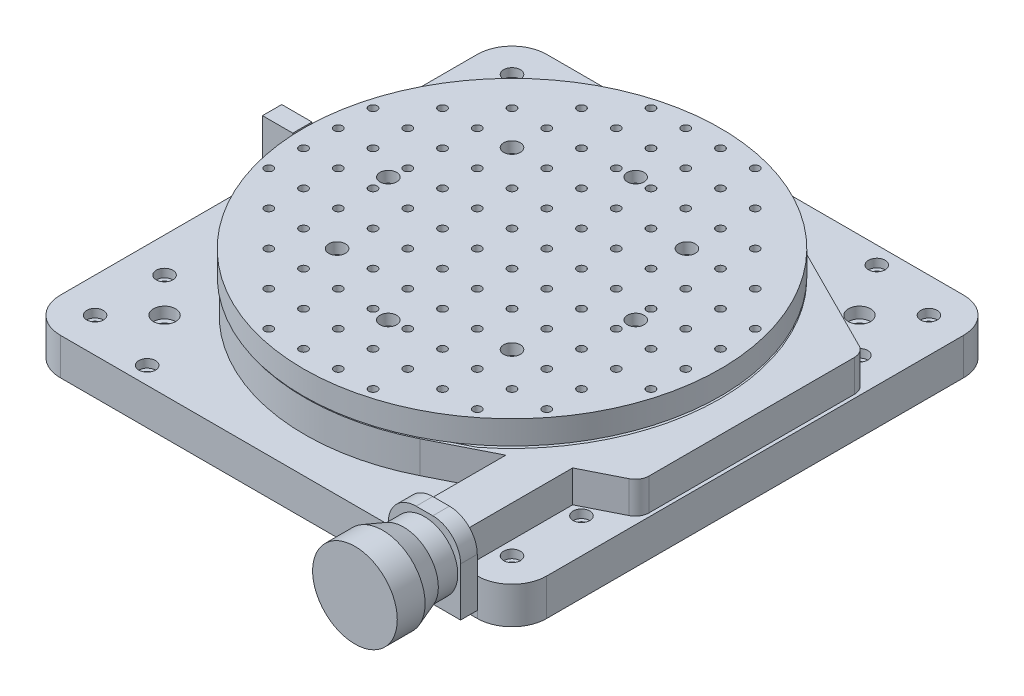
from build123d import *

# Parameters (mm, degrees)
SKETCH1_R            = 45
BOSS_EXTRUDE1_DEPTH  = 26.5
BOSS_EXTRUDE2_DEPTH  = 23
SKETCH3_R            = 55.758206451
SKETCH3_R_2          = 45
BOSS_EXTRUDE3_DEPTH  = 24.5
SKETCH4_R            = 150
SKETCH4_R_2          = 45
BOSS_EXTRUDE4_DEPTH  = 17
BOSS_EXTRUDE6_START  = -2
BOSS_EXTRUDE6_DEPTH  = 2
BOSS_EXTRUDE7_DEPTH  = 21
BOSS_EXTRUDE8_DEPTH  = 75
SKETCH9_W            = 94.583503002
SKETCH9_H            = 30
BOSS_EXTRUDE9_DEPTH  = 25
CHAMFER1_SIZE        = 3
SKETCH10_R           = 4.5
SKETCH10_R_2         = 3.25
CUT_EXTRUDE1_DEPTH   = 98
SKETCH11_R           = 8
CUT_EXTRUDE2_DEPTH   = 8
SKETCH12_R           = 6
CUT_EXTRUDE3_DEPTH   = 6
SKETCH14_R           = 3.5
CUT_EXTRUDE4_DEPTH   = 18
SKETCH15_R           = 6
CUT_EXTRUDE5_DEPTH   = 8
SKETCH16_R           = 3
CUT_EXTRUDE6_DEPTH   = 8
SKETCH17_W           = 21.793248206
SKETCH17_H           = 13.859681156
BOSS_EXTRUDE11_DEPTH = 41.5
SKETCH19_W           = 101.812352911
SKETCH19_H           = 99.807594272
CUT_EXTRUDE7_DEPTH   = 107
SKETCH20_W           = 84
SKETCH20_H           = 45
BOSS_EXTRUDE12_DEPTH = 26.5
FILLET1_R            = 25
SKETCH21_W           = 52
SKETCH21_H           = 55
BOSS_EXTRUDE13_DEPTH = 12
BOSS_EXTRUDE14_REACH = 409.79
SKETCH22_W           = 32
SKETCH22_H           = 34
SKETCH24_R           = 24
BOSS_EXTRUDE15_DEPTH = 15
SKETCH25_R           = 25
BOSS_EXTRUDE16_DEPTH = 15
BOSS_EXTRUDE16_DRAFT = -20
SKETCH26_R           = 30.459553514
BOSS_EXTRUDE17_DEPTH = 20
FILLET4_R            = 20
BOSS_EXTRUDE18_START = -12
SKETCH27_R           = 45
BOSS_EXTRUDE18_DEPTH = 12
SKETCH28_R           = 3
CUT_EXTRUDE8_DEPTH   = 10
SKETCH30_R           = 6
CUT_EXTRUDE9_DEPTH   = 6
SKETCH31_R           = 3.25
CUT_EXTRUDE10_DEPTH  = 66
SKETCH32_R           = 45
BOSS_EXTRUDE19_DEPTH = 10


with BuildPart() as part:
    # Sketch1 → Boss-Extrude1 (new body)
    with BuildSketch(Plane(origin=(0, 0, 0), x_dir=(1, 0, 0), z_dir=(0, 1, 0))):
        with BuildLine():
            Line((-150, 175), (150, 175))
            ThreePointArc((150, 175), (167.67766953, 167.67766953), (175, 150))
            Line((175, 150), (175, -130))
            Line((175, -130), (91, -130))
            Line((91, -130), (91, -175))
            Line((91, -175), (-150, -175))
            ThreePointArc((-150, -175), (-167.67766953, -167.67766953), (-175, -150))
            Line((-175, -150), (-175, 150))
            ThreePointArc((-175, 150), (-167.67766953, 167.67766953), (-150, 175))
        make_face()
        with Locations(Location((0, 0, 0), (0, 0, 270))):
            Circle(SKETCH1_R, mode=Mode.SUBTRACT)
    extrude(amount=BOSS_EXTRUDE1_DEPTH)

    # Sketch2 → Boss-Extrude2 (add)
    with BuildSketch(Plane(origin=(0, 26.5, 0), x_dir=(1, 0, 0), z_dir=(0, 1, 0))):
        with BuildLine():
            Line((172.5, 73.837252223), (172.5, -73.837252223))
            ThreePointArc((172.5, -73.837252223), (171.013198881, -79.083721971), (166.994911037, -82.7701003))
            Line((166.994911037, -82.7701003), (66.974174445, -133.099436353))
            ThreePointArc((66.974174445, -133.099436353), (-149, 0), (66.974174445, 133.099436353))
            Line((66.974174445, 133.099436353), (166.994911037, 82.7701003))
            ThreePointArc((166.994911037, 82.7701003), (171.013198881, 79.083721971), (172.5, 73.837252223))
        make_face()
        with BuildLine():
            Line((66.075192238, -131.312866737), (166.095928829, -80.983530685))
            ThreePointArc((166.095928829, -80.983530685), (169.310559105, -78.034428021), (170.5, -73.837252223))
            Line((170.5, -73.837252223), (170.5, 73.837252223))
            ThreePointArc((170.5, 73.837252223), (169.310559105, 78.034428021), (166.095928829, 80.983530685))
            Line((166.095928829, 80.983530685), (66.075192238, 131.312866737))
            ThreePointArc((66.075192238, 131.312866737), (-147, 0), (66.075192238, -131.312866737))
        make_face(mode=Mode.SUBTRACT)
    extrude(amount=BOSS_EXTRUDE2_DEPTH)

    # Sketch3 → Boss-Extrude3 (add)
    with BuildSketch(Plane(origin=(0, 26.5, 0), x_dir=(1, 0, 0), z_dir=(0, 1, 0))):
        with Locations(Location((0, 0, 0), (0, 0, 90))):
            Circle(SKETCH3_R)
        with Locations(Location((0, 0, 0), (0, 0, 270))):
            Circle(SKETCH3_R_2, mode=Mode.SUBTRACT)
    extrude(amount=BOSS_EXTRUDE3_DEPTH)

    # Sketch4 → Boss-Extrude4 (add)
    with BuildSketch(Plane(origin=(0, 51, 0), x_dir=(1, 0, 0), z_dir=(0, 1, 0))):
        with Locations(Location((0, 0, 0), (0, 0, 270))):
            Circle(SKETCH4_R)
        with Locations(Location((0, 0, 0), (0, 0, 270))):
            Circle(SKETCH4_R_2, mode=Mode.SUBTRACT)
    extrude(amount=BOSS_EXTRUDE4_DEPTH)

    # Sketch5 → Boss-Extrude6 (add)
    with BuildSketch(Plane(origin=(0, 49.5, 0), x_dir=(1, 0, 0), z_dir=(0, 1, 0)).offset(BOSS_EXTRUDE6_START)):
        with BuildLine():
            Line((82.420512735, -125.327008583), (166.994911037, -82.7701003))
            ThreePointArc((166.994911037, -82.7701003), (171.013198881, -79.083721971), (172.5, -73.837252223))
            Line((172.5, -73.837252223), (172.5, 73.837252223))
            ThreePointArc((172.5, 73.837252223), (171.013198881, 79.083721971), (166.994911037, 82.7701003))
            Line((166.994911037, 82.7701003), (82.420512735, 125.327008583))
            ThreePointArc((82.420512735, 125.327008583), (150, 0), (82.420512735, -125.327008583))
        make_face()
    extrude(amount=BOSS_EXTRUDE6_DEPTH)

    # Sketch7 → Boss-Extrude7 (add)
    with BuildSketch(Plane.XY.offset(130)):
        with BuildLine():
            Line((99, 64), (149, 64))
            ThreePointArc((149, 64), (152.535533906, 62.535533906), (154, 59))
            Line((154, 59), (154, 6))
            ThreePointArc((154, 6), (152.535533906, 2.464466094), (149, 1))
            Line((149, 1), (99, 1))
            ThreePointArc((99, 1), (95.464466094, 2.464466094), (94, 6))
            Line((94, 6), (94, 59))
            ThreePointArc((94, 59), (95.464466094, 62.535533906), (99, 64))
        make_face()
    extrude(amount=BOSS_EXTRUDE7_DEPTH)

    # Sketch8 → Boss-Extrude8 (add)
    with BuildSketch(Plane.XY.offset(151)):
        with BuildLine():
            Line((97.136050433, 2.826690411), (150.863949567, 2.826690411))
            ThreePointArc((150.863949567, 2.826690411), (152.278163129, 3.412476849), (152.863949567, 4.826690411))
            Line((152.863949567, 4.826690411), (152.863949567, 60.173309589))
            ThreePointArc((152.863949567, 60.173309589), (152.278163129, 61.587523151), (150.863949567, 62.173309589))
            Line((150.863949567, 62.173309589), (97.136050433, 62.173309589))
            ThreePointArc((97.136050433, 62.173309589), (95.721836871, 61.587523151), (95.136050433, 60.173309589))
            Line((95.136050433, 60.173309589), (95.136050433, 4.826690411))
            ThreePointArc((95.136050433, 4.826690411), (95.721836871, 3.412476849), (97.136050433, 2.826690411))
        make_face()
    extrude(amount=BOSS_EXTRUDE8_DEPTH)

    # Sketch9 → Boss-Extrude9 (add)
    with BuildSketch(Plane(origin=(154, 0, 0), x_dir=(0, 0, -1), z_dir=(1, 0, 0))):
        with Locations((-178.708248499, 33.283024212)):
            Rectangle(SKETCH9_W, SKETCH9_H)
    extrude(amount=BOSS_EXTRUDE9_DEPTH)

    # Chamfer1
    chamfer1_edges = [part.edges().sort_by_distance(p)[0] for p in [
        (179, 48.283024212, 178.708248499),
        (179, 18.283024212, 178.708248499),
    ]]
    chamfer(chamfer1_edges, length=CHAMFER1_SIZE)

    # Sketch10 → Cut-Extrude1 (cut)
    with BuildSketch(Plane(origin=(0, 26.5, 0), x_dir=(1, 0, 0), z_dir=(0, 1, 0))):
        with Locations(Location((-125, 125, 0), (0, 0, 270))):
            Circle(SKETCH10_R)
        with Locations(Location((125, 125, 0), (0, 0, 270))):
            Circle(SKETCH10_R)
        with Locations(Location((-125, -125, 0), (0, 0, 270))):
            Circle(SKETCH10_R)
        with Locations(Location((-150, 150, 0), (0, 0, 270))):
            Circle(SKETCH10_R_2)
        with Locations(Location((150, 150, 0), (0, 0, 270))):
            Circle(SKETCH10_R_2)
        with Locations(Location((-150, -150, 0), (0, 0, 270))):
            Circle(SKETCH10_R_2)
        with Locations(Location((-150, -100, 0), (0, 0, 270))):
            Circle(SKETCH10_R_2)
        with Locations(Location((-150, 100, 0), (0, 0, 270))):
            Circle(SKETCH10_R_2)
        with Locations(Location((150, 100, 0), (0, 0, 270))):
            Circle(SKETCH10_R_2)
        with Locations(Location((150, -100, 0), (0, 0, 270))):
            Circle(SKETCH10_R_2)
        with Locations(Location((-100, -162.5, 0), (0, 0, 270))):
            Circle(SKETCH10_R_2)
        with Locations(Location((-100, 162.5, 0), (0, 0, 270))):
            Circle(SKETCH10_R_2)
        with Locations(Location((100, 162.5, 0), (0, 0, 270))):
            Circle(SKETCH10_R_2)
    extrude(amount=-CUT_EXTRUDE1_DEPTH, mode=Mode.SUBTRACT)

    # Sketch11 → Cut-Extrude2 (cut)
    with BuildSketch(Plane(origin=(0, 26.5, 0), x_dir=(1, 0, 0), z_dir=(0, 1, 0))):
        with Locations(Location((-125, 125, 0), (0, 0, 270))):
            Circle(SKETCH11_R)
        with Locations(Location((125, 125, 0), (0, 0, 270))):
            Circle(SKETCH11_R)
        with Locations(Location((-125, -125, 0), (0, 0, 270))):
            Circle(SKETCH11_R)
    extrude(amount=-CUT_EXTRUDE2_DEPTH, mode=Mode.SUBTRACT)

    # Sketch12 → Cut-Extrude3 (cut)
    with BuildSketch(Plane(origin=(0, 26.5, 0), x_dir=(1, 0, 0), z_dir=(0, 1, 0))):
        with Locations(Location((-100, 162.5, 0), (0, 0, 270))):
            Circle(SKETCH12_R)
        with Locations(Location((-150, 100, 0), (0, 0, 270))):
            Circle(SKETCH12_R)
        with Locations(Location((-150, 150, 0), (0, 0, 270))):
            Circle(SKETCH12_R)
        with Locations(Location((100, 162.5, 0), (0, 0, 270))):
            Circle(SKETCH12_R)
        with Locations(Location((150, 150, 0), (0, 0, 270))):
            Circle(SKETCH12_R)
        with Locations(Location((150, 100, 0), (0, 0, 270))):
            Circle(SKETCH12_R)
        with Locations(Location((150, -100, 0), (0, 0, 270))):
            Circle(SKETCH12_R)
        with Locations(Location((-100, -162.5, 0), (0, 0, 270))):
            Circle(SKETCH12_R)
        with Locations(Location((-150, -150, 0), (0, 0, 270))):
            Circle(SKETCH12_R)
        with Locations(Location((-150, -100, 0), (0, 0, 270))):
            Circle(SKETCH12_R)
    extrude(amount=-CUT_EXTRUDE3_DEPTH, mode=Mode.SUBTRACT)

    # Sketch14 → Cut-Extrude4 (cut)
    with BuildSketch(Plane(origin=(0, 68, 0), x_dir=(1, 0, 0), z_dir=(0, 1, 0))):
        with Locations(Location((0, 89, 0), (0, 0, 270))):
            Circle(SKETCH14_R)
        with Locations(Location((62.932503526, 62.932503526, 0), (0, 0, 270))):
            Circle(SKETCH14_R)
        with Locations(Location((89, 0, 0), (0, 0, 270))):
            Circle(SKETCH14_R)
        with Locations(Location((62.932503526, -62.932503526, 0), (0, 0, 270))):
            Circle(SKETCH14_R)
        with Locations(Location((0, -89, 0), (0, 0, 270))):
            Circle(SKETCH14_R)
        with Locations(Location((-62.932503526, -62.932503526, 0), (0, 0, 270))):
            Circle(SKETCH14_R)
        with Locations(Location((-89, 0, 0), (0, 0, 270))):
            Circle(SKETCH14_R)
        with Locations(Location((-62.932503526, 62.932503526, 0), (0, 0, 270))):
            Circle(SKETCH14_R)
    extrude(amount=-CUT_EXTRUDE4_DEPTH, mode=Mode.SUBTRACT)

    # Sketch15 → Cut-Extrude5 (cut)
    with BuildSketch(Plane(origin=(0, 68, 0), x_dir=(1, 0, 0), z_dir=(0, 1, 0))):
        with Locations(Location((0, 89, 0), (0, 0, 270))):
            Circle(SKETCH15_R)
        with Locations(Location((62.932503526, 62.932503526, 0), (0, 0, 270))):
            Circle(SKETCH15_R)
        with Locations(Location((89, 0, 0), (0, 0, 270))):
            Circle(SKETCH15_R)
        with Locations(Location((62.932503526, -62.932503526, 0), (0, 0, 270))):
            Circle(SKETCH15_R)
        with Locations(Location((0, -89, 0), (0, 0, 270))):
            Circle(SKETCH15_R)
        with Locations(Location((-62.932503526, -62.932503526, 0), (0, 0, 270))):
            Circle(SKETCH15_R)
        with Locations(Location((-89, 0, 0), (0, 0, 270))):
            Circle(SKETCH15_R)
        with Locations(Location((-62.932503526, 62.932503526, 0), (0, 0, 270))):
            Circle(SKETCH15_R)
    extrude(amount=-CUT_EXTRUDE5_DEPTH, mode=Mode.SUBTRACT)

    # Sketch16 → Cut-Extrude6 (cut)
    with BuildSketch(Plane(origin=(0, 68, 0), x_dir=(1, 0, 0), z_dir=(0, 1, 0))):
        with Locations(Location((-37.5, 37.5, 0), (0, 0, 270))):
            Circle(SKETCH16_R)
        with Locations(Location((37.5, 37.5, 0), (0, 0, 270))):
            Circle(SKETCH16_R)
        with Locations(Location((37.5, -37.5, 0), (0, 0, 270))):
            Circle(SKETCH16_R)
        with Locations(Location((-37.5, -37.5, 0), (0, 0, 270))):
            Circle(SKETCH16_R)
        with Locations(Location((-62.5, 37.5, 0), (0, 0, 270))):
            Circle(SKETCH16_R)
        with Locations(Location((-87.5, 37.5, 0), (0, 0, 270))):
            Circle(SKETCH16_R)
        with Locations(Location((-112.5, 37.5, 0), (0, 0, 270))):
            Circle(SKETCH16_R)
        with Locations(Location((-137.5, 37.5, 0), (0, 0, 270))):
            Circle(SKETCH16_R)
        with Locations(Location((-87.5, 62.5, 0), (0, 0, 270))):
            Circle(SKETCH16_R)
        with Locations(Location((-112.5, 62.5, 0), (0, 0, 270))):
            Circle(SKETCH16_R)
        with Locations((-12.5, 37.5)):
            Circle(SKETCH16_R)
        with Locations(Location((-62.5, 87.5, 0), (0, 0, 270))):
            Circle(SKETCH16_R)
        with Locations(Location((-87.5, 87.5, 0), (0, 0, 270))):
            Circle(SKETCH16_R)
        with Locations(Location((-12.5, 62.5, 0), (0, 0, 270))):
            Circle(SKETCH16_R)
        with Locations(Location((-12.5, 87.5, 0), (0, 0, 270))):
            Circle(SKETCH16_R)
        with Locations(Location((-62.5, 112.5, 0), (0, 0, 270))):
            Circle(SKETCH16_R)
        with Locations(Location((-12.5, 112.5, 0), (0, 0, 270))):
            Circle(SKETCH16_R)
        with Locations(Location((-12.5, 137.5, 0), (0, 0, 270))):
            Circle(SKETCH16_R)
        with Locations((12.5, 37.5)):
            Circle(SKETCH16_R)
        with Locations(Location((12.5, 62.5, 0), (0, 0, 270))):
            Circle(SKETCH16_R)
        with Locations(Location((12.5, 87.5, 0), (0, 0, 270))):
            Circle(SKETCH16_R)
        with Locations(Location((12.5, 112.5, 0), (0, 0, 270))):
            Circle(SKETCH16_R)
        with Locations(Location((12.5, 137.5, 0), (0, 0, 270))):
            Circle(SKETCH16_R)
        with Locations(Location((-37.5, 62.5, 0), (0, 0, 270))):
            Circle(SKETCH16_R)
        with Locations(Location((-37.5, 87.5, 0), (0, 0, 270))):
            Circle(SKETCH16_R)
        with Locations(Location((-37.5, 112.5, 0), (0, 0, 270))):
            Circle(SKETCH16_R)
        with Locations(Location((-37.5, -137.5, 0), (0, 0, 270))):
            Circle(SKETCH16_R)
        with Locations(Location((37.5, 62.5, 0), (0, 0, 270))):
            Circle(SKETCH16_R)
        with Locations(Location((37.5, 87.5, 0), (0, 0, 270))):
            Circle(SKETCH16_R)
        with Locations(Location((37.5, 112.5, 0), (0, 0, 270))):
            Circle(SKETCH16_R)
        with Locations(Location((37.5, -137.5, 0), (0, 0, 270))):
            Circle(SKETCH16_R)
        with Locations(Location((62.5, 37.5, 0), (0, 0, 270))):
            Circle(SKETCH16_R)
        with Locations(Location((62.5, 87.5, 0), (0, 0, 270))):
            Circle(SKETCH16_R)
        with Locations(Location((62.5, 112.5, 0), (0, 0, 270))):
            Circle(SKETCH16_R)
        with Locations((-37.5, 12.5)):
            Circle(SKETCH16_R)
        with Locations(Location((87.5, 37.5, 0), (0, 0, 270))):
            Circle(SKETCH16_R)
        with Locations(Location((87.5, 62.5, 0), (0, 0, 270))):
            Circle(SKETCH16_R)
        with Locations(Location((87.5, 87.5, 0), (0, 0, 270))):
            Circle(SKETCH16_R)
        with Locations((37.5, 12.5)):
            Circle(SKETCH16_R)
        with Locations(Location((-62.5, 12.5, 0), (0, 0, 270))):
            Circle(SKETCH16_R)
        with Locations(Location((112.5, 37.5, 0), (0, 0, 270))):
            Circle(SKETCH16_R)
        with Locations(Location((112.5, 62.5, 0), (0, 0, 270))):
            Circle(SKETCH16_R)
        with Locations(Location((-87.5, 12.5, 0), (0, 0, 270))):
            Circle(SKETCH16_R)
        with Locations(Location((-112.5, 12.5, 0), (0, 0, 270))):
            Circle(SKETCH16_R)
        with Locations(Location((-137.5, 12.5, 0), (0, 0, 270))):
            Circle(SKETCH16_R)
        with Locations(Location((137.5, 37.5, 0), (0, 0, 270))):
            Circle(SKETCH16_R)
        with Locations((-12.5, 12.5)):
            Circle(SKETCH16_R)
        with Locations((12.5, 12.5)):
            Circle(SKETCH16_R)
        with Locations(Location((62.5, 12.5, 0), (0, 0, 270))):
            Circle(SKETCH16_R)
        with Locations(Location((87.5, 12.5, 0), (0, 0, 270))):
            Circle(SKETCH16_R)
        with Locations(Location((112.5, 12.5, 0), (0, 0, 270))):
            Circle(SKETCH16_R)
        with Locations(Location((137.5, 12.5, 0), (0, 0, 270))):
            Circle(SKETCH16_R)
        with Locations((-37.5, -12.5)):
            Circle(SKETCH16_R)
        with Locations((37.5, -12.5)):
            Circle(SKETCH16_R)
        with Locations(Location((-62.5, -12.5, 0), (0, 0, 270))):
            Circle(SKETCH16_R)
        with Locations(Location((-87.5, -12.5, 0), (0, 0, 270))):
            Circle(SKETCH16_R)
        with Locations(Location((-112.5, -12.5, 0), (0, 0, 270))):
            Circle(SKETCH16_R)
        with Locations(Location((-137.5, -12.5, 0), (0, 0, 270))):
            Circle(SKETCH16_R)
        with Locations((-12.5, -12.5)):
            Circle(SKETCH16_R)
        with Locations((12.5, -12.5)):
            Circle(SKETCH16_R)
        with Locations(Location((62.5, -12.5, 0), (0, 0, 270))):
            Circle(SKETCH16_R)
        with Locations(Location((87.5, -12.5, 0), (0, 0, 270))):
            Circle(SKETCH16_R)
        with Locations(Location((112.5, -12.5, 0), (0, 0, 270))):
            Circle(SKETCH16_R)
        with Locations(Location((137.5, -12.5, 0), (0, 0, 270))):
            Circle(SKETCH16_R)
        with Locations(Location((-62.5, -37.5, 0), (0, 0, 270))):
            Circle(SKETCH16_R)
        with Locations(Location((-87.5, -37.5, 0), (0, 0, 270))):
            Circle(SKETCH16_R)
        with Locations(Location((-112.5, -37.5, 0), (0, 0, 270))):
            Circle(SKETCH16_R)
        with Locations(Location((-137.5, -37.5, 0), (0, 0, 270))):
            Circle(SKETCH16_R)
        with Locations((-12.5, -37.5)):
            Circle(SKETCH16_R)
        with Locations((12.5, -37.5)):
            Circle(SKETCH16_R)
        with Locations(Location((62.5, -37.5, 0), (0, 0, 270))):
            Circle(SKETCH16_R)
        with Locations(Location((87.5, -37.5, 0), (0, 0, 270))):
            Circle(SKETCH16_R)
        with Locations(Location((112.5, -37.5, 0), (0, 0, 270))):
            Circle(SKETCH16_R)
        with Locations(Location((137.5, -37.5, 0), (0, 0, 270))):
            Circle(SKETCH16_R)
        with Locations(Location((-37.5, -62.5, 0), (0, 0, 270))):
            Circle(SKETCH16_R)
        with Locations(Location((37.5, -62.5, 0), (0, 0, 270))):
            Circle(SKETCH16_R)
        with Locations(Location((-87.5, -62.5, 0), (0, 0, 270))):
            Circle(SKETCH16_R)
        with Locations(Location((-112.5, -62.5, 0), (0, 0, 270))):
            Circle(SKETCH16_R)
        with Locations(Location((-37.5, 137.5, 0), (0, 0, 270))):
            Circle(SKETCH16_R)
        with Locations(Location((-12.5, -62.5, 0), (0, 0, 270))):
            Circle(SKETCH16_R)
        with Locations(Location((12.5, -62.5, 0), (0, 0, 270))):
            Circle(SKETCH16_R)
        with Locations(Location((87.5, -62.5, 0), (0, 0, 270))):
            Circle(SKETCH16_R)
        with Locations(Location((112.5, -62.5, 0), (0, 0, 270))):
            Circle(SKETCH16_R)
        with Locations(Location((37.5, 137.5, 0), (0, 0, 270))):
            Circle(SKETCH16_R)
        with Locations(Location((-37.5, -87.5, 0), (0, 0, 270))):
            Circle(SKETCH16_R)
        with Locations(Location((37.5, -87.5, 0), (0, 0, 270))):
            Circle(SKETCH16_R)
        with Locations(Location((-62.5, -87.5, 0), (0, 0, 270))):
            Circle(SKETCH16_R)
        with Locations(Location((-87.5, -87.5, 0), (0, 0, 270))):
            Circle(SKETCH16_R)
        with Locations(Location((-12.5, -87.5, 0), (0, 0, 270))):
            Circle(SKETCH16_R)
        with Locations(Location((12.5, -87.5, 0), (0, 0, 270))):
            Circle(SKETCH16_R)
        with Locations(Location((62.5, -87.5, 0), (0, 0, 270))):
            Circle(SKETCH16_R)
        with Locations(Location((87.5, -87.5, 0), (0, 0, 270))):
            Circle(SKETCH16_R)
        with Locations(Location((112.5, -87.5, 0), (0, 0, 270))):
            Circle(SKETCH16_R)
        with Locations(Location((-37.5, -112.5, 0), (0, 0, 270))):
            Circle(SKETCH16_R)
        with Locations(Location((37.5, -112.5, 0), (0, 0, 270))):
            Circle(SKETCH16_R)
        with Locations(Location((-62.5, -112.5, 0), (0, 0, 270))):
            Circle(SKETCH16_R)
        with Locations(Location((-12.5, -112.5, 0), (0, 0, 270))):
            Circle(SKETCH16_R)
        with Locations(Location((12.5, -112.5, 0), (0, 0, 270))):
            Circle(SKETCH16_R)
        with Locations(Location((62.5, -112.5, 0), (0, 0, 270))):
            Circle(SKETCH16_R)
        with Locations(Location((87.5, -112.5, 0), (0, 0, 270))):
            Circle(SKETCH16_R)
        with Locations(Location((-12.5, -137.5, 0), (0, 0, 270))):
            Circle(SKETCH16_R)
        with Locations(Location((12.5, -137.5, 0), (0, 0, 270))):
            Circle(SKETCH16_R)
    extrude(amount=-CUT_EXTRUDE6_DEPTH, mode=Mode.SUBTRACT)

    # Sketch17 → Boss-Extrude11 (add)
    with BuildSketch(Plane(origin=(0, 26.5, 0), x_dir=(1, 0, 0), z_dir=(0, 1, 0))):
        with Locations((-161.703672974, 0)):
            Rectangle(SKETCH17_W, SKETCH17_H)
    extrude(amount=BOSS_EXTRUDE11_DEPTH)

    # Sketch19 → Cut-Extrude7 (cut)
    with BuildSketch(Plane.XZ):
        with Locations((141.906176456, 179.903797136)):
            Rectangle(SKETCH19_W, SKETCH19_H)
    extrude(amount=-CUT_EXTRUDE7_DEPTH, mode=Mode.SUBTRACT)

    # Sketch20 → Boss-Extrude12 (add)
    with BuildSketch(Plane(origin=(0, 26.5, 0), x_dir=(1, 0, 0), z_dir=(0, 1, 0))):
        with Locations((133, -152.5)):
            Rectangle(SKETCH20_W, SKETCH20_H)
    extrude(amount=-BOSS_EXTRUDE12_DEPTH)

    # Fillet1
    fillet1_edges = [part.edges().sort_by_distance(p)[0] for p in [
        (175, 13.25, 175),
    ]]
    fillet(fillet1_edges, radius=FILLET1_R)

    # Sketch21 → Boss-Extrude13 (add)
    with BuildSketch(Plane.XY.offset(175)):
        with Locations((124, 32.5)):
            Rectangle(SKETCH21_W, SKETCH21_H)
    extrude(amount=BOSS_EXTRUDE13_DEPTH)

    # Boss-Extrude14: up to this plane
    boss_extrude14_end = Plane(origin=(66.974174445, 49.5, 133.099436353), z_dir=(-0.4494911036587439, 0, -0.8932848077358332))
    # Sketch22 → Boss-Extrude14 (add, up to the surface)
    with BuildSketch(Plane.XY.offset(187), mode=Mode.PRIVATE) as boss_extrude14_sk1:
        with Locations((124, 32.5)):
            Rectangle(SKETCH22_W, SKETCH22_H)
    boss_extrude14_tool1 = split(extrude(boss_extrude14_sk1.sketch, amount=-BOSS_EXTRUDE14_REACH, mode=Mode.PRIVATE), bisect_by=boss_extrude14_end, keep=Keep.BOTH, mode=Mode.PRIVATE)
    add(boss_extrude14_tool1.solids().sort_by_distance((124, 32.5, 187))[0])

    # Sketch24 → Boss-Extrude15 (add)
    with BuildSketch(Plane.XY.offset(187)):
        with Locations(Location((124, 32.5, 0), (0, 0, 180))):
            Circle(SKETCH24_R)
    extrude(amount=BOSS_EXTRUDE15_DEPTH)


with BuildPart() as boss_extrude16_tool:
    # Sketch25 → Boss-Extrude16 (with draft: the straight prism first)
    with BuildSketch(Plane.XY.offset(202)):
        with Locations((124, 32.5)):
            Circle(SKETCH25_R)
    extrude(amount=BOSS_EXTRUDE16_DEPTH)
    # Boss-Extrude16: the draft: its side faces are tilted about the plane it starts from
    boss_extrude16_sides = [boss_extrude16_tool.faces().sort_by_distance(p)[0] for p in [
        (99, 32.5, 209.5),
    ]]
    draft(boss_extrude16_sides, Plane.XY.offset(202), BOSS_EXTRUDE16_DRAFT)


with BuildPart() as part_1:
    add(part.part)

    # Boss-Extrude16: add boss_extrude16_tool
    add(boss_extrude16_tool.part)

    # Sketch26 → Boss-Extrude17 (add)
    with BuildSketch(Plane.XY.offset(217)):
        with Locations((124, 32.5)):
            Circle(SKETCH26_R)
    extrude(amount=BOSS_EXTRUDE17_DEPTH)

    # Fillet4
    fillet4_edges = [part_1.edges().sort_by_distance(p)[0] for p in [
        (150, 60, 181),
        (98, 60, 181),
    ]]
    fillet(fillet4_edges, radius=FILLET4_R)

    # Sketch27 → Boss-Extrude18 (add)
    with BuildSketch(Plane(origin=(0, 68, 0), x_dir=(1, 0, 0), z_dir=(0, 1, 0)).offset(BOSS_EXTRUDE18_START)):
        with Locations(Location((0, 0, 0), (0, 0, 270))):
            Circle(SKETCH27_R)
    extrude(amount=BOSS_EXTRUDE18_DEPTH)

    # Sketch28 → Cut-Extrude8 (cut)
    with BuildSketch(Plane(origin=(0, 68, 0), x_dir=(1, 0, 0), z_dir=(0, 1, 0))):
        with Locations(Location((-37.5, 37.5, 0), (0, 0, 270))):
            Circle(SKETCH28_R)
        with Locations(Location((-12.5, 37.5, 0), (0, 0, 270))):
            Circle(SKETCH28_R)
        with Locations(Location((12.5, 37.5, 0), (0, 0, 270))):
            Circle(SKETCH28_R)
        with Locations(Location((12.5, 12.5, 0), (0, 0, 270))):
            Circle(SKETCH28_R)
        with Locations(Location((-12.5, 12.5, 0), (0, 0, 270))):
            Circle(SKETCH28_R)
        with Locations(Location((-37.5, 12.5, 0), (0, 0, 270))):
            Circle(SKETCH28_R)
        with Locations(Location((-37.5, -12.5, 0), (0, 0, 270))):
            Circle(SKETCH28_R)
        with Locations(Location((-12.5, -12.5, 0), (0, 0, 270))):
            Circle(SKETCH28_R)
        with Locations(Location((12.5, -12.5, 0), (0, 0, 270))):
            Circle(SKETCH28_R)
        with Locations(Location((37.5, -12.5, 0), (0, 0, 270))):
            Circle(SKETCH28_R)
        with Locations(Location((37.5, 12.5, 0), (0, 0, 270))):
            Circle(SKETCH28_R)
        with Locations(Location((12.5, -37.5, 0), (0, 0, 270))):
            Circle(SKETCH28_R)
        with Locations(Location((-12.5, -37.5, 0), (0, 0, 270))):
            Circle(SKETCH28_R)
    extrude(amount=-CUT_EXTRUDE8_DEPTH, mode=Mode.SUBTRACT)

    # Sketch30 → Cut-Extrude9 (cut)
    with BuildSketch(Plane(origin=(0, 26.5, 0), x_dir=(1, 0, 0), z_dir=(0, 1, 0))):
        with Locations(Location((150, -150, 0), (0, 0, 90))):
            Circle(SKETCH30_R)
        with Locations(Location((100, -162.5, 0), (0, 0, 90))):
            Circle(SKETCH30_R)
    extrude(amount=-CUT_EXTRUDE9_DEPTH, mode=Mode.SUBTRACT)

    # Sketch31 → Cut-Extrude10 (cut)
    with BuildSketch(Plane(origin=(0, 20.5, 0), x_dir=(1, 0, 0), z_dir=(0, 1, 0))):
        with Locations(Location((100, -162.5, 0), (0, 0, 270))):
            Circle(SKETCH31_R)
        with Locations(Location((150, -150, 0), (0, 0, 270))):
            Circle(SKETCH31_R)
    extrude(amount=-CUT_EXTRUDE10_DEPTH, mode=Mode.SUBTRACT)

    # Sketch32 → Boss-Extrude19 (add)
    with BuildSketch(Plane.XZ):
        with Locations(Location((0, 0, 0), (0, 0, 270))):
            Circle(SKETCH32_R)
    extrude(amount=-BOSS_EXTRUDE19_DEPTH)


solid = part_1.part
